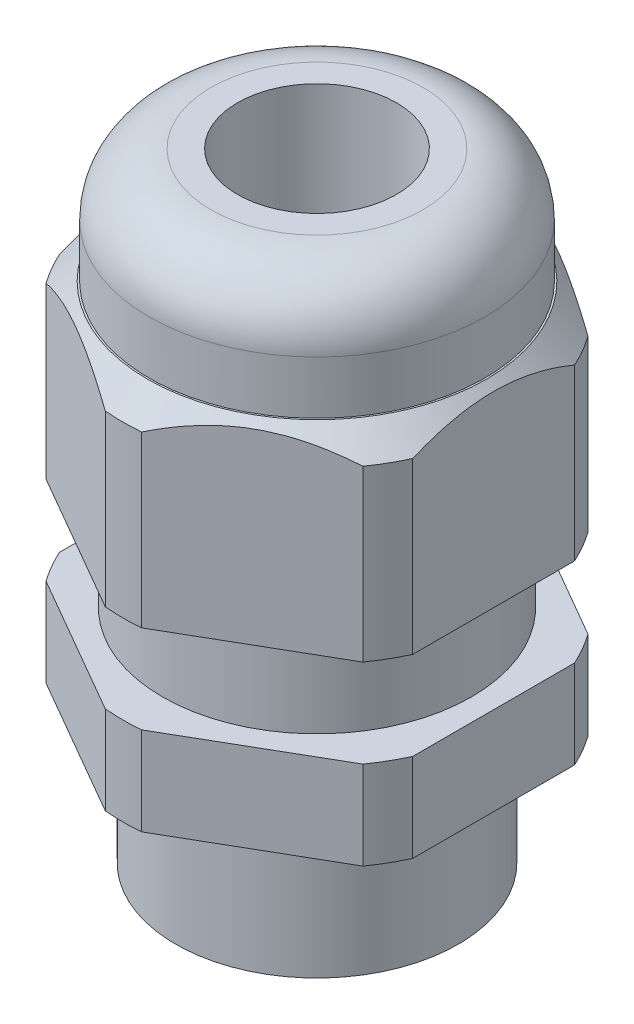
from build123d import *

# Parameters (mm, degrees)
CONG_1_R                = 3.5
CHANFREIN2_SIZE         = 1.4
ESQUISSE2_OUTSIDE_W     = 33.366
ESQUISSE2_OUTSIDE_H     = 33.366
ENL_V_MAT_EXTRU_1_DEPTH = 33.46921619


with BuildPart() as part:
    # Esquisse1 → R_volution1 (revolve)
    with BuildSketch(Plane.XY, mode=Mode.PRIVATE) as r_volution1_sk:
        Polygon((5.5, 0), (8, 0), (8, 7.5), (11, 7.5), (11, 12.5), (8.75, 12.5), (8.75, 17.5), (11, 17.5), (11, 28.5), (9.5, 28.5), (9.5, 35), (4.5, 35), (4.5, 24.054778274), (5.5, 24.054778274), align=None)
    revolve(r_volution1_sk.sketch.rotate(Axis((0, 0, 0), (0, 1, 0)), 90), axis=Axis((0, 0, 0), (0, 1, 0)))

    # Cong_1
    cong_1_edges = [part.edges().sort_by_distance(p)[0] for p in [
        (0, 35, 9.5),
    ]]
    fillet(cong_1_edges, radius=CONG_1_R)

    # Chanfrein2
    chanfrein2_edges = [part.edges().sort_by_distance(p)[0] for p in [
        (0, 28.5, 11),
    ]]
    chamfer(chanfrein2_edges, length=CHANFREIN2_SIZE)

    # Esquisse2 outside → Enl_v. mat.-Extru.1 (cut, through all)
    with BuildSketch(Plane(origin=(0, 28.5, 0), x_dir=(-1, 0, 0), z_dir=(0, 1, 0))):
        Rectangle(ESQUISSE2_OUTSIDE_W, ESQUISSE2_OUTSIDE_H)
        Polygon((-10, 5.773502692), (-10, -5.773502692), (0, -11.547005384), (10, -5.773502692), (10, 5.773502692), (0, 11.547005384), align=None, mode=Mode.SUBTRACT)
    extrude(amount=-ENL_V_MAT_EXTRU_1_DEPTH, mode=Mode.SUBTRACT)


solid = part.part
